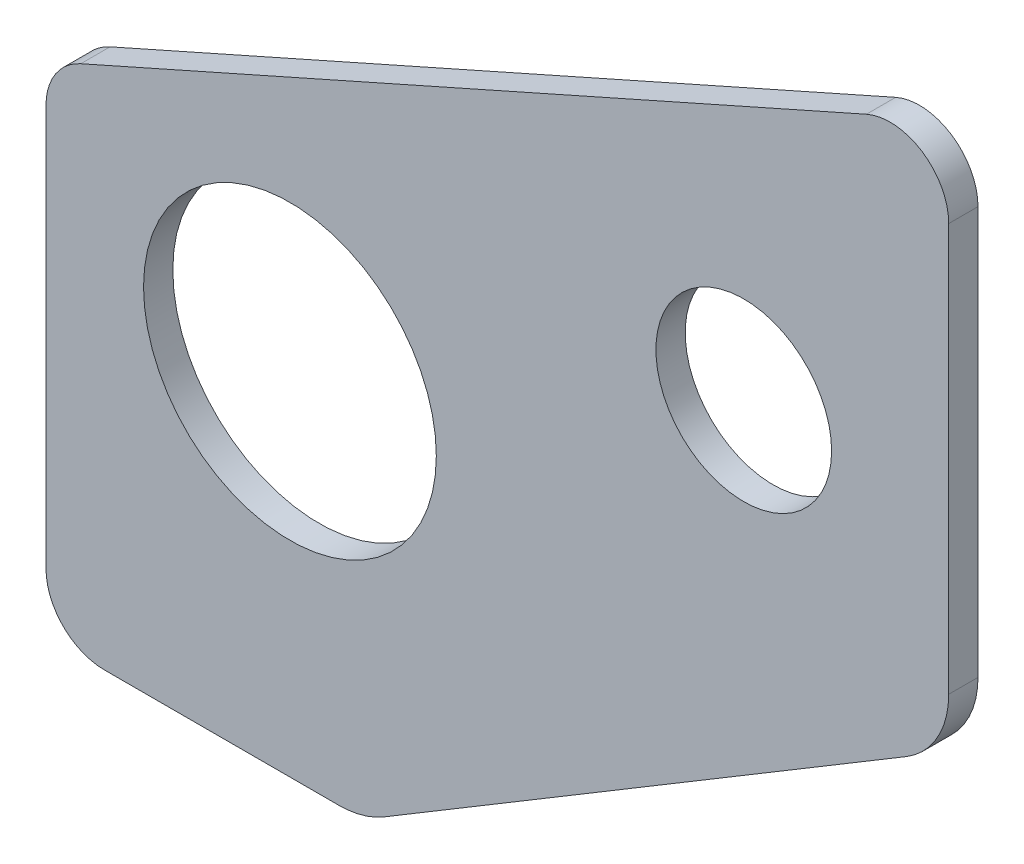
from build123d import *

# Parameters (mm, degrees)
ESQUISSE1_R      = 3
ESQUISSE1_R_2    = 5
EXTRUSION1_DEPTH = 1


with BuildPart() as part:
    # Esquisse1 → Extrusion1 (new body)
    with BuildSketch(Plane.XY):
        with BuildLine():
            Line((13.572680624, 60.693877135), (-13.258271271, 48.772555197))
            ThreePointArc((-13.258271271, 48.772555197), (-14.123120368, 48.034762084), (-14.446196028, 46.944842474))
            Line((-14.446196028, 46.944842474), (-14.446196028, 33.244745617))
            ThreePointArc((-14.446196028, 33.244745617), (-13.86040959, 31.830532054), (-12.446196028, 31.244745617))
            Line((-12.446196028, 31.244745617), (-4.446196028, 31.244745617))
            ThreePointArc((-4.446196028, 31.244745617), (-3.645395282, 31.353600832), (-2.902708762, 31.67226684))
            Line((-2.902708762, 31.67226684), (14.928243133, 42.370837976))
            ThreePointArc((14.928243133, 42.370837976), (15.995355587, 43.465220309), (16.384755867, 44.943316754))
            Line((16.384755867, 44.943316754), (16.384755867, 58.866164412))
            ThreePointArc((16.384755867, 58.866164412), (15.474675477, 60.543088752), (13.572680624, 60.693877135))
        make_face()
        with Locations((9.384755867, 50.139469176)):
            Circle(ESQUISSE1_R, mode=Mode.SUBTRACT)
        with Locations((-6.115244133, 43.244745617)):
            Circle(ESQUISSE1_R_2, mode=Mode.SUBTRACT)
    extrude(amount=-EXTRUSION1_DEPTH)


solid = part.part
